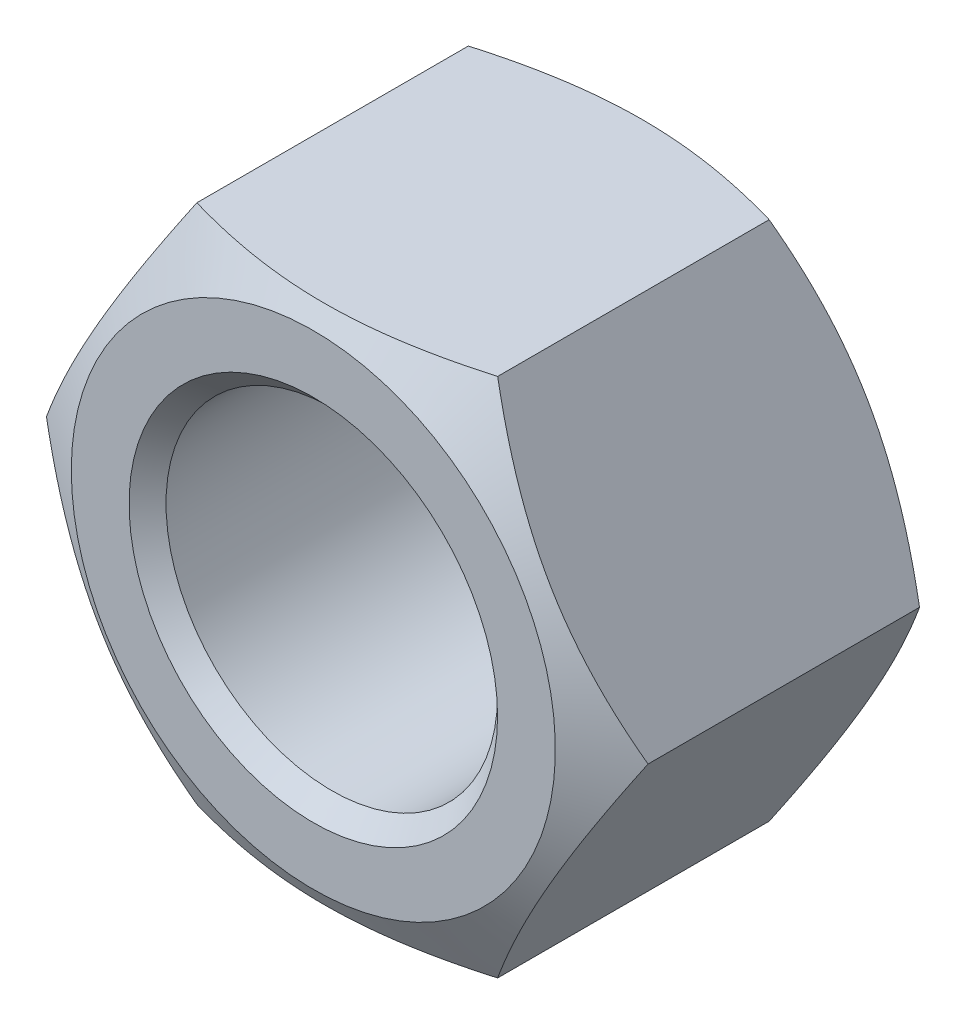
from build123d import *

# Parameters (mm, degrees)
SKETCH1_R        = 17.5
BASENUT_DEPTH    = 34.7
ENDCHAMFER2_SIZE = 1.95


with BuildPart() as part:
    # Sketch1 → BaseNut (new body)
    with BuildSketch(Plane.XY):
        Polygon((15.877132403, -27.5), (31.754264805, 0), (15.877132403, 27.5), (-15.877132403, 27.5), (-31.754264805, 0), (-15.877132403, -27.5), align=None)
        Circle(SKETCH1_R, mode=Mode.SUBTRACT)
    extrude(amount=-BASENUT_DEPTH)

    # Sketch2 → Chamfer1 (revolve, cut)
    with BuildSketch(Plane(origin=(15.04811501, 0, -16.706149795), x_dir=(0, 0, -1), z_dir=(0, 1, 0))):
        Polygon((15.537649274, 46.802379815), (17.993850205, 42.54811501), (17.993850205, 46.802379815), align=None)
    revolve(axis=Axis((0, 0, 7.016501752), (0, 0, -1)), mode=Mode.SUBTRACT)

    # Sketch6 → EndChamfer1 (revolve, cut)
    with BuildSketch(Plane(origin=(-9.197458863, 0, -10.252541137), x_dir=(0, 0, 1), z_dir=(0, 1, 0))):
        Polygon((-24.447458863, 26.697458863), (-24.447458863, 28.647458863), (-23.321625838, 26.697458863), align=None)
    revolve(axis=Axis((0, 0, 13.104863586), (0, 0, -1)), mode=Mode.SUBTRACT)

    # Sketch5 → Chamfer2 (revolve, cut)
    with BuildSketch(Plane(origin=(-14.793032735, 0, -16.96123207), x_dir=(0, 0, 1), z_dir=(0, 1, 0)), mode=Mode.PRIVATE) as chamfer2_sk:
        Polygon((16.96123207, 40.343032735), (16.96123207, 46.547297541), (13.379198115, 46.547297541), align=None)
    revolve(chamfer2_sk.sketch.rotate(Axis((0, 0, -39.536013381), (0, 0, 1)), 180), axis=Axis((0, 0, -39.536013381), (0, 0, 1)), mode=Mode.SUBTRACT)

    # EndChamfer2
    endchamfer2_edges = [part.edges().sort_by_distance(p)[0] for p in [
        (-17.5, 0, 0),
    ]]
    chamfer(endchamfer2_edges, length=ENDCHAMFER2_SIZE)


solid = part.part
